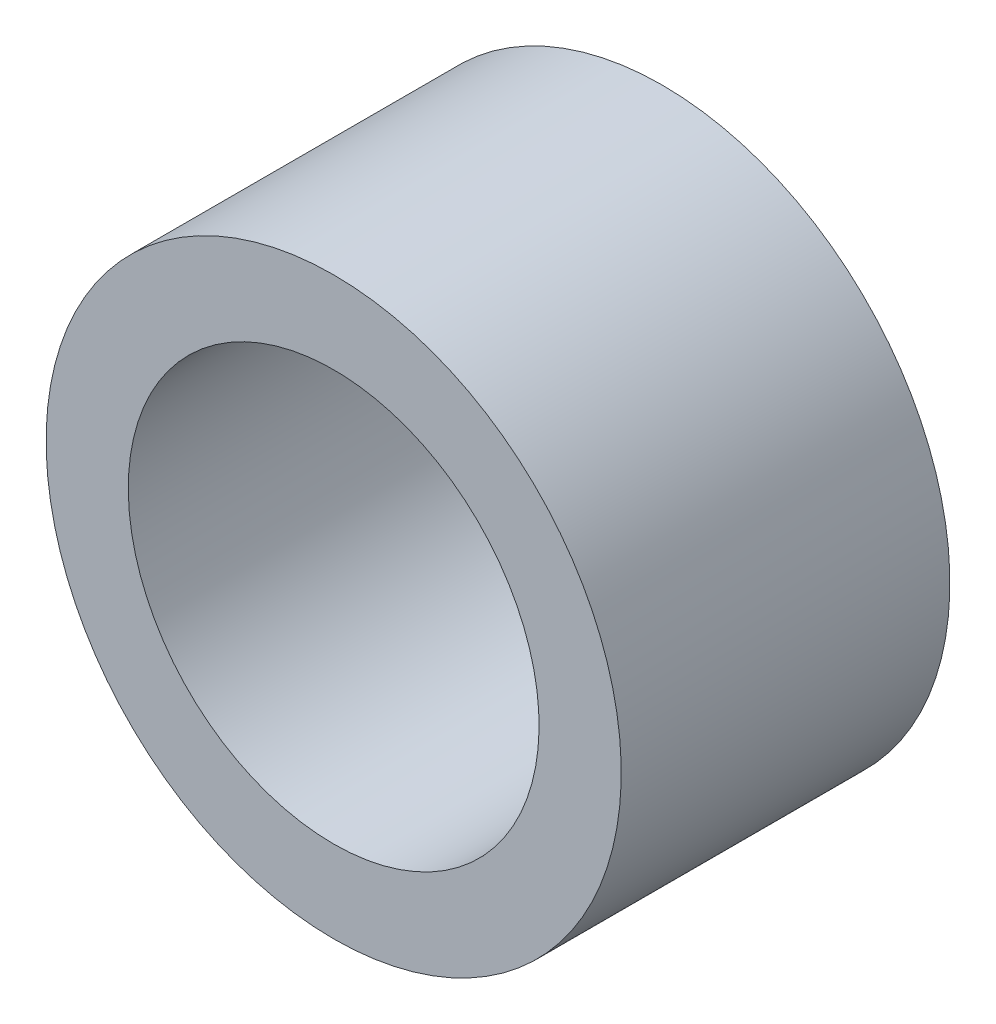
ISO-10303-21;
HEADER;
FILE_DESCRIPTION(('STEP AP214'),'2;1');
FILE_NAME('part.step','',(''),(''),'','','');
FILE_SCHEMA(('AUTOMOTIVE_DESIGN { 1 0 10303 214 1 1 1 1 }'));
ENDSEC;
DATA;
#1=APPLICATION_CONTEXT('core data for automotive mechanical design processes');
#2=APPLICATION_PROTOCOL_DEFINITION('international standard','automotive_design',2000,#1);
#3=PRODUCT_CONTEXT('',#1,'mechanical');
#4=PRODUCT('Part','Part','',(#3));
#5=PRODUCT_RELATED_PRODUCT_CATEGORY('part','',(#4));
#6=PRODUCT_DEFINITION_FORMATION('','',#4);
#7=PRODUCT_DEFINITION_CONTEXT('part definition',#1,'design');
#8=PRODUCT_DEFINITION('design','',#6,#7);
#9=PRODUCT_DEFINITION_SHAPE('','',#8);
#10=(LENGTH_UNIT() NAMED_UNIT(*) SI_UNIT(.MILLI.,.METRE.));
#11=(NAMED_UNIT(*) PLANE_ANGLE_UNIT() SI_UNIT($,.RADIAN.));
#12=(NAMED_UNIT(*) SI_UNIT($,.STERADIAN.) SOLID_ANGLE_UNIT());
#13=UNCERTAINTY_MEASURE_WITH_UNIT(LENGTH_MEASURE(1.E-05),#10,'distance_accuracy_value','');
#14=(GEOMETRIC_REPRESENTATION_CONTEXT(3) GLOBAL_UNCERTAINTY_ASSIGNED_CONTEXT((#13)) GLOBAL_UNIT_ASSIGNED_CONTEXT((#10,
#11,#12)) REPRESENTATION_CONTEXT('',''));
#15=CARTESIAN_POINT('',(0.,0.,0.));
#16=DIRECTION('',(0.,0.,1.));
#17=DIRECTION('',(1.,0.,0.));
#18=AXIS2_PLACEMENT_3D('',#15,#16,#17);
#19=CARTESIAN_POINT('',(17.5,0.,0.));
#20=DIRECTION('',(0.,0.,1.));
#21=DIRECTION('',(0.,-1.,0.));
#22=AXIS2_PLACEMENT_3D('',#19,#20,#21);
#23=PLANE('',#22);
#24=CARTESIAN_POINT('',(0.,0.,0.));
#25=DIRECTION('',(0.,0.,1.));
#26=DIRECTION('',(0.,-1.,0.));
#27=AXIS2_PLACEMENT_3D('',#24,#25,#26);
#28=CIRCLE('',#27,12.5);
#29=CARTESIAN_POINT('',(0.,-12.5,0.));
#30=VERTEX_POINT('',#29);
#31=EDGE_CURVE('E22',#30,#30,#28,.T.);
#32=ORIENTED_EDGE('',*,*,#31,.T.);
#33=EDGE_LOOP('',(#32));
#34=FACE_BOUND('',#33,.T.);
#35=CARTESIAN_POINT('',(0.,0.,0.));
#36=DIRECTION('',(0.,0.,-1.));
#37=DIRECTION('',(0.,1.,0.));
#38=AXIS2_PLACEMENT_3D('',#35,#36,#37);
#39=CIRCLE('',#38,17.5);
#40=CARTESIAN_POINT('',(0.,17.5,0.));
#41=VERTEX_POINT('',#40);
#42=EDGE_CURVE('E8',#41,#41,#39,.T.);
#43=ORIENTED_EDGE('',*,*,#42,.T.);
#44=EDGE_LOOP('',(#43));
#45=FACE_BOUND('',#44,.T.);
#46=ADVANCED_FACE('F12',(#34,#45),#23,.F.);
#47=CARTESIAN_POINT('',(0.,0.,-20.));
#48=DIRECTION('',(0.,0.,-1.));
#49=DIRECTION('',(0.,1.,0.));
#50=AXIS2_PLACEMENT_3D('',#47,#48,#49);
#51=CYLINDRICAL_SURFACE('',#50,17.5);
#52=ORIENTED_EDGE('',*,*,#42,.F.);
#53=EDGE_LOOP('',(#52));
#54=FACE_BOUND('',#53,.T.);
#55=CARTESIAN_POINT('',(0.,0.,20.));
#56=DIRECTION('',(0.,0.,-1.));
#57=DIRECTION('',(0.,1.,0.));
#58=AXIS2_PLACEMENT_3D('',#55,#56,#57);
#59=CIRCLE('',#58,17.5);
#60=CARTESIAN_POINT('',(0.,17.5,20.));
#61=VERTEX_POINT('',#60);
#62=EDGE_CURVE('E18',#61,#61,#59,.T.);
#63=ORIENTED_EDGE('',*,*,#62,.T.);
#64=EDGE_LOOP('',(#63));
#65=FACE_BOUND('',#64,.T.);
#66=ADVANCED_FACE('F37',(#54,#65),#51,.T.);
#67=CARTESIAN_POINT('',(0.,0.,20.));
#68=DIRECTION('',(0.,0.,-1.));
#69=DIRECTION('',(0.,1.,0.));
#70=AXIS2_PLACEMENT_3D('',#67,#68,#69);
#71=PLANE('',#70);
#72=CARTESIAN_POINT('',(0.,0.,20.));
#73=DIRECTION('',(0.,0.,1.));
#74=DIRECTION('',(0.,-1.,0.));
#75=AXIS2_PLACEMENT_3D('',#72,#73,#74);
#76=CIRCLE('',#75,12.5);
#77=CARTESIAN_POINT('',(0.,-12.5,20.));
#78=VERTEX_POINT('',#77);
#79=EDGE_CURVE('E26',#78,#78,#76,.T.);
#80=ORIENTED_EDGE('',*,*,#79,.F.);
#81=EDGE_LOOP('',(#80));
#82=FACE_BOUND('',#81,.T.);
#83=ORIENTED_EDGE('',*,*,#62,.F.);
#84=EDGE_LOOP('',(#83));
#85=FACE_BOUND('',#84,.T.);
#86=ADVANCED_FACE('F34',(#82,#85),#71,.F.);
#87=CARTESIAN_POINT('',(0.,0.,0.));
#88=DIRECTION('',(0.,0.,1.));
#89=DIRECTION('',(0.,-1.,0.));
#90=AXIS2_PLACEMENT_3D('',#87,#88,#89);
#91=CYLINDRICAL_SURFACE('',#90,12.5);
#92=ORIENTED_EDGE('',*,*,#31,.F.);
#93=EDGE_LOOP('',(#92));
#94=FACE_BOUND('',#93,.T.);
#95=ORIENTED_EDGE('',*,*,#79,.T.);
#96=EDGE_LOOP('',(#95));
#97=FACE_BOUND('',#96,.T.);
#98=ADVANCED_FACE('F32',(#94,#97),#91,.F.);
#99=CLOSED_SHELL('',(#46,#66,#86,#98));
#100=MANIFOLD_SOLID_BREP('B1',#99);
#101=ADVANCED_BREP_SHAPE_REPRESENTATION('',(#18,#100),#14);
#102=SHAPE_DEFINITION_REPRESENTATION(#9,#101);
ENDSEC;
END-ISO-10303-21;
